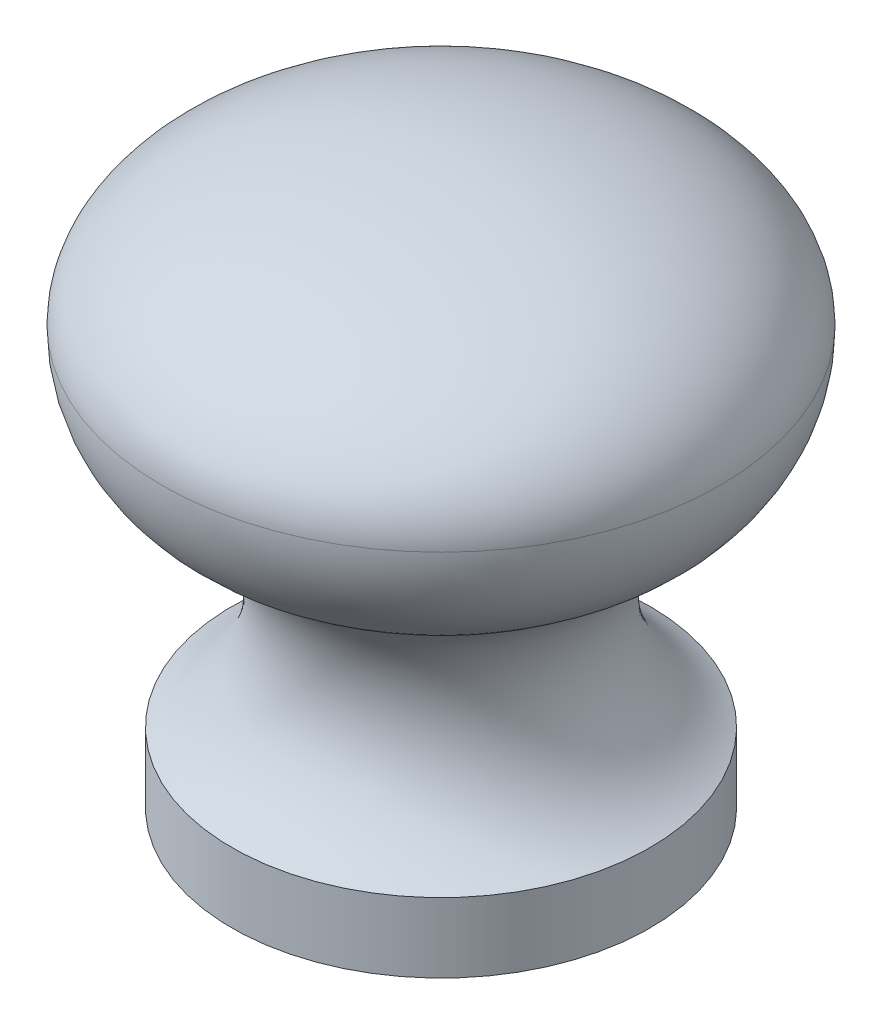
from build123d import *

# Parameters (mm, degrees)
F_8_32_TAPPED_HOLE1_D           = 3.4544
F_8_32_TAPPED_HOLE1_DEPTH       = 15.07744
F_8_32_TAPPED_HOLE1_CBORE_D     = 4.1656
F_8_32_TAPPED_HOLE1_CBORE_DEPTH = 12.7
F_8_32_TAPPED_HOLE1_TIP         = 1.037806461


with BuildPart() as part:
    # Sketch1 → Base-Revolve (revolve)
    with BuildSketch(Plane.XY, mode=Mode.PRIVATE) as base_revolve_sk:
        with BuildLine():
            Line((0, 0), (-9.525, 0))
            Line((-9.525, 0), (-9.525, 3.175))
            ThreePointArc((-9.525, 3.175), (-6.350520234, 8.282737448), (-9.387318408, 13.47351393))
            ThreePointArc((-9.387318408, 13.47351393), (-11.809371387, 15.806889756), (-12.7, 19.05))
            add(Edge.make_bspline(
                [(0, 25.4), (-12.7, 25.4), (-12.7, 19.05)],
                knots=[4.71238898, 4.71238898, 4.71238898, 6.283185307, 6.283185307, 6.283185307], degree=2, weights=[1, 0.707106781, 1]))
            Line((0, 25.4), (0, 0))
        make_face()
    revolve(base_revolve_sk.sketch.rotate(Axis((0, 0, 0), (0, 1, 0)), 270), axis=Axis((0, 0, 0), (0, 1, 0)))

    # 8-32 Tapped Hole1
    with Locations(Plane.XZ):
        with Locations((0, 0)):
            CounterBoreHole(F_8_32_TAPPED_HOLE1_D / 2, F_8_32_TAPPED_HOLE1_CBORE_D / 2, F_8_32_TAPPED_HOLE1_CBORE_DEPTH, depth=F_8_32_TAPPED_HOLE1_DEPTH)
            with Locations((0, 0, -(F_8_32_TAPPED_HOLE1_DEPTH + F_8_32_TAPPED_HOLE1_TIP / 2))):  # 118° drill point
                Cone(0, F_8_32_TAPPED_HOLE1_D / 2, F_8_32_TAPPED_HOLE1_TIP, mode=Mode.SUBTRACT)


solid = part.part
